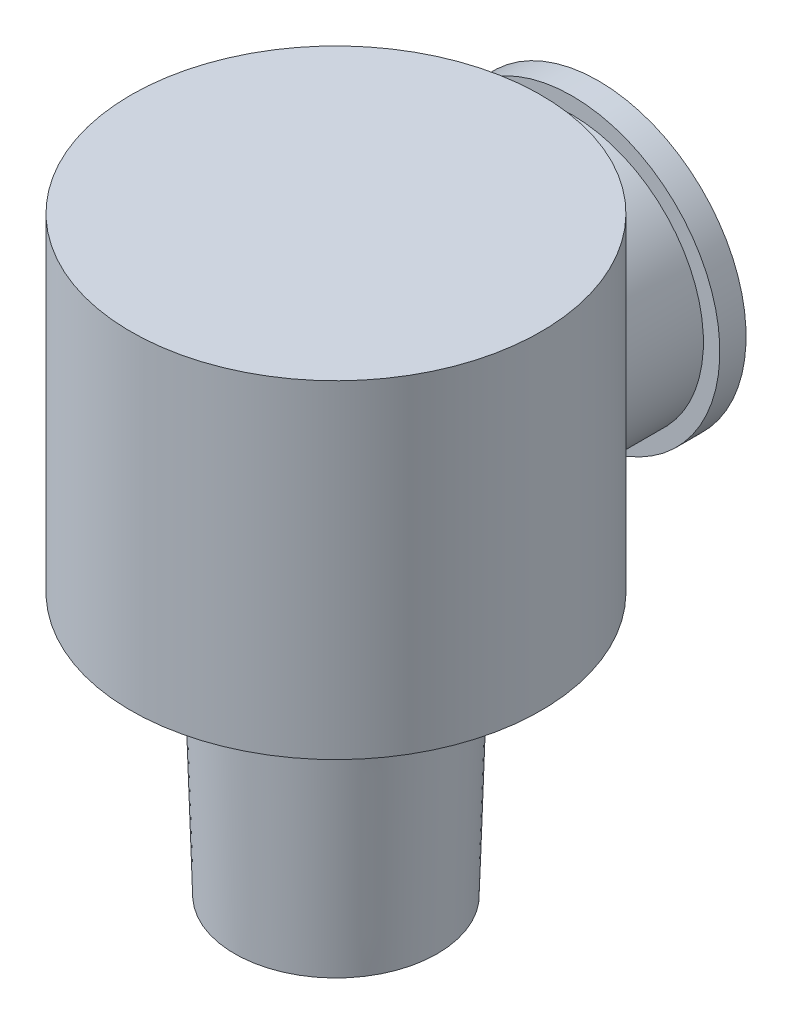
ISO-10303-21;
HEADER;
FILE_DESCRIPTION(('STEP AP214'),'2;1');
FILE_NAME('part.step','',(''),(''),'','','');
FILE_SCHEMA(('AUTOMOTIVE_DESIGN { 1 0 10303 214 1 1 1 1 }'));
ENDSEC;
DATA;
#1=APPLICATION_CONTEXT('core data for automotive mechanical design processes');
#2=APPLICATION_PROTOCOL_DEFINITION('international standard','automotive_design',2000,#1);
#3=PRODUCT_CONTEXT('',#1,'mechanical');
#4=PRODUCT('Part','Part','',(#3));
#5=PRODUCT_RELATED_PRODUCT_CATEGORY('part','',(#4));
#6=PRODUCT_DEFINITION_FORMATION('','',#4);
#7=PRODUCT_DEFINITION_CONTEXT('part definition',#1,'design');
#8=PRODUCT_DEFINITION('design','',#6,#7);
#9=PRODUCT_DEFINITION_SHAPE('','',#8);
#10=(LENGTH_UNIT() NAMED_UNIT(*) SI_UNIT(.MILLI.,.METRE.));
#11=(NAMED_UNIT(*) PLANE_ANGLE_UNIT() SI_UNIT($,.RADIAN.));
#12=(NAMED_UNIT(*) SI_UNIT($,.STERADIAN.) SOLID_ANGLE_UNIT());
#13=UNCERTAINTY_MEASURE_WITH_UNIT(LENGTH_MEASURE(1.E-05),#10,'distance_accuracy_value','');
#14=(GEOMETRIC_REPRESENTATION_CONTEXT(3) GLOBAL_UNCERTAINTY_ASSIGNED_CONTEXT((#13)) GLOBAL_UNIT_ASSIGNED_CONTEXT((#10,
#11,#12)) REPRESENTATION_CONTEXT('',''));
#15=CARTESIAN_POINT('',(0.,0.,0.));
#16=DIRECTION('',(0.,0.,1.));
#17=DIRECTION('',(1.,0.,0.));
#18=AXIS2_PLACEMENT_3D('',#15,#16,#17);
#19=CARTESIAN_POINT('',(0.,-10.31875,0.));
#20=DIRECTION('',(0.,1.,0.));
#21=DIRECTION('',(-1.,0.,0.));
#22=AXIS2_PLACEMENT_3D('',#19,#20,#21);
#23=CYLINDRICAL_SURFACE('',#22,9.921875);
#24=CARTESIAN_POINT('',(0.,2.38125,0.));
#25=DIRECTION('',(0.,1.,0.));
#26=DIRECTION('',(-1.,0.,0.));
#27=AXIS2_PLACEMENT_3D('',#24,#25,#26);
#28=CIRCLE('',#27,9.921875);
#29=CARTESIAN_POINT('',(-9.921875,2.38125,0.));
#30=VERTEX_POINT('',#29);
#31=EDGE_CURVE('E82',#30,#30,#28,.T.);
#32=ORIENTED_EDGE('',*,*,#31,.T.);
#33=EDGE_LOOP('',(#32));
#34=FACE_BOUND('',#33,.T.);
#35=CARTESIAN_POINT('',(0.,18.25625,0.));
#36=DIRECTION('',(0.,1.,0.));
#37=DIRECTION('',(-1.,0.,0.));
#38=AXIS2_PLACEMENT_3D('',#35,#36,#37);
#39=CIRCLE('',#38,9.921875);
#40=CARTESIAN_POINT('',(-9.921875,18.25625,0.));
#41=VERTEX_POINT('',#40);
#42=EDGE_CURVE('E85',#41,#41,#39,.T.);
#43=ORIENTED_EDGE('',*,*,#42,.F.);
#44=EDGE_LOOP('',(#43));
#45=FACE_BOUND('',#44,.T.);
#46=CARTESIAN_POINT('',(0.,3.96875,-9.921875));
#47=CARTESIAN_POINT('',(-0.16070407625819,3.96874943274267,-9.92187549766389));
#48=CARTESIAN_POINT('',(-0.321402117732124,3.97485798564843,-9.91796259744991));
#49=CARTESIAN_POINT('',(-0.641558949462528,3.99920227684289,-9.90240874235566));
#50=CARTESIAN_POINT('',(-0.801017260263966,4.01744249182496,-9.89076493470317));
#51=CARTESIAN_POINT('',(-1.11757950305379,4.06581573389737,-9.86001734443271));
#52=CARTESIAN_POINT('',(-1.27468038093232,4.09596300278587,-9.84090462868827));
#53=CARTESIAN_POINT('',(-1.58526394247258,4.16774540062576,-9.79567176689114));
#54=CARTESIAN_POINT('',(-1.73874506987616,4.20938537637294,-9.76954866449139));
#55=CARTESIAN_POINT('',(-2.04021533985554,4.30336889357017,-9.71105381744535));
#56=CARTESIAN_POINT('',(-2.18822988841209,4.35565276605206,-9.67871696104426));
#57=CARTESIAN_POINT('',(-2.47885929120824,4.47048496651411,-9.60839512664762));
#58=CARTESIAN_POINT('',(-2.62147202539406,4.53303727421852,-9.57040795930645));
#59=CARTESIAN_POINT('',(-3.03999522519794,4.73513486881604,-9.44913597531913));
#60=CARTESIAN_POINT('',(-3.30691329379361,4.88922290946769,-9.35847557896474));
#61=CARTESIAN_POINT('',(-3.83309318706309,5.24537437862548,-9.15625482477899));
#62=CARTESIAN_POINT('',(-4.08994408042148,5.45033054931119,-9.04359164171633));
#63=CARTESIAN_POINT('',(-4.56806919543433,5.89583982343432,-8.81174985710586));
#64=CARTESIAN_POINT('',(-4.78929329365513,6.13644218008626,-8.69256238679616));
#65=CARTESIAN_POINT('',(-5.10645740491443,6.53967288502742,-8.50797266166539));
#66=CARTESIAN_POINT('',(-5.2155033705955,6.69161774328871,-8.44137673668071));
#67=CARTESIAN_POINT('',(-5.42032291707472,7.00547886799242,-8.31134284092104));
#68=CARTESIAN_POINT('',(-5.51609382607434,7.1673971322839,-8.24790550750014));
#69=CARTESIAN_POINT('',(-5.78205586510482,7.66691958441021,-8.06581856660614));
#70=CARTESIAN_POINT('',(-5.9315347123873,8.01909774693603,-7.95500354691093));
#71=CARTESIAN_POINT('',(-6.13459670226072,8.65489231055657,-7.79886266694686));
#72=CARTESIAN_POINT('',(-6.20317385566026,8.93135317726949,-7.74393345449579));
#73=CARTESIAN_POINT('',(-6.27789649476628,9.35385995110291,-7.68326579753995));
#74=CARTESIAN_POINT('',(-6.29811169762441,9.49595479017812,-7.66666597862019));
#75=CARTESIAN_POINT('',(-6.32889855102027,9.78190842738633,-7.64127399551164));
#76=CARTESIAN_POINT('',(-6.33947009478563,9.92576724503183,-7.63248191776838));
#77=CARTESIAN_POINT('',(-6.35079574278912,10.2145877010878,-7.6230602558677));
#78=CARTESIAN_POINT('',(-6.35151908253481,10.3595513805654,-7.62245625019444));
#79=CARTESIAN_POINT('',(-6.34305974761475,10.64898544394,-7.62949714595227));
#80=CARTESIAN_POINT('',(-6.33387702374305,10.7934558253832,-7.63714208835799));
#81=CARTESIAN_POINT('',(-6.30575342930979,11.0808715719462,-7.66037915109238));
#82=CARTESIAN_POINT('',(-6.28680749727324,11.2238161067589,-7.67597539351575));
#83=CARTESIAN_POINT('',(-6.23946140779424,11.5071468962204,-7.7145087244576));
#84=CARTESIAN_POINT('',(-6.21105731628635,11.647532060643,-7.73744886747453));
#85=CARTESIAN_POINT('',(-6.11421904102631,12.0551502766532,-7.81451545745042));
#86=CARTESIAN_POINT('',(-6.03323180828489,12.3178083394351,-7.87770732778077));
#87=CARTESIAN_POINT('',(-5.8403758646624,12.8260694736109,-8.02172205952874));
#88=CARTESIAN_POINT('',(-5.72849689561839,13.0716668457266,-8.10255077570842));
#89=CARTESIAN_POINT('',(-5.45212101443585,13.5896551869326,-8.29162600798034));
#90=CARTESIAN_POINT('',(-5.28163304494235,13.8580460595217,-8.40215208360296));
#91=CARTESIAN_POINT('',(-4.99845093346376,14.2383214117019,-8.57153922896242));
#92=CARTESIAN_POINT('',(-4.89938518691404,14.3614572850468,-8.6286517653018));
#93=CARTESIAN_POINT('',(-4.69233544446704,14.6000378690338,-8.74297191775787));
#94=CARTESIAN_POINT('',(-4.58434983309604,14.7154811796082,-8.80017954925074));
#95=CARTESIAN_POINT('',(-4.33926160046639,14.9586109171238,-8.92393121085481));
#96=CARTESIAN_POINT('',(-4.20044462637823,15.0846783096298,-8.99027050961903));
#97=CARTESIAN_POINT('',(-3.91135827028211,15.3246512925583,-9.11975621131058));
#98=CARTESIAN_POINT('',(-3.76109268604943,15.4385608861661,-9.18290366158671));
#99=CARTESIAN_POINT('',(-3.44976660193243,15.6532926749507,-9.30433308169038));
#100=CARTESIAN_POINT('',(-3.28871271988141,15.7541227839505,-9.36261798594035));
#101=CARTESIAN_POINT('',(-2.95654102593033,15.9417136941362,-9.47275351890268));
#102=CARTESIAN_POINT('',(-2.78542602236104,16.0284783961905,-9.52460593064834));
#103=CARTESIAN_POINT('',(-2.46900977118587,16.1711303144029,-9.61087453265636));
#104=CARTESIAN_POINT('',(-2.32531221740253,16.2297292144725,-9.64670979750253));
#105=CARTESIAN_POINT('',(-2.03283654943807,16.3365820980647,-9.71255034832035));
#106=CARTESIAN_POINT('',(-1.88405943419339,16.3848381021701,-9.7425567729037));
#107=CARTESIAN_POINT('',(-1.58235034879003,16.4704359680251,-9.79608231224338));
#108=CARTESIAN_POINT('',(-1.42942097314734,16.5077844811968,-9.81960538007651));
#109=CARTESIAN_POINT('',(-1.12031615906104,16.5711318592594,-9.85965412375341));
#110=CARTESIAN_POINT('',(-0.964140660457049,16.5971305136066,-9.87617966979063));
#111=CARTESIAN_POINT('',(-0.649144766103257,16.6374846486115,-9.90188202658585));
#112=CARTESIAN_POINT('',(-0.490317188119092,16.6518002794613,-9.91103368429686));
#113=CARTESIAN_POINT('',(-0.17177656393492,16.6684293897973,-9.92166774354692));
#114=CARTESIAN_POINT('',(-0.01206351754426,16.6707428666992,-9.92315014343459));
#115=CARTESIAN_POINT('',(0.306976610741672,16.6633325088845,-9.91840827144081));
#116=CARTESIAN_POINT('',(0.466303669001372,16.6536079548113,-9.91218353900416));
#117=CARTESIAN_POINT('',(0.783296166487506,16.6222661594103,-9.89218250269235));
#118=CARTESIAN_POINT('',(0.940961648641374,16.600649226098,-9.87840639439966));
#119=CARTESIAN_POINT('',(1.24509401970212,16.5472957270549,-9.84456614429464));
#120=CARTESIAN_POINT('',(1.39170896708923,16.5161619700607,-9.82487755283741));
#121=CARTESIAN_POINT('',(1.68151415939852,16.443890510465,-9.77945140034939));
#122=CARTESIAN_POINT('',(1.8247032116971,16.4027493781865,-9.7537117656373));
#123=CARTESIAN_POINT('',(2.24780678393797,16.2649825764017,-9.66817086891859));
#124=CARTESIAN_POINT('',(2.52150144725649,16.1539698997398,-9.60001927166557));
#125=CARTESIAN_POINT('',(3.06636576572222,15.8881885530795,-9.44074202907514));
#126=CARTESIAN_POINT('',(3.33584053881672,15.7307839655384,-9.34828673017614));
#127=CARTESIAN_POINT('',(3.84586190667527,15.3811205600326,-9.15029603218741));
#128=CARTESIAN_POINT('',(4.08638581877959,15.1888347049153,-9.04475050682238));
#129=CARTESIAN_POINT('',(4.57034084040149,14.7413110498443,-8.81125420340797));
#130=CARTESIAN_POINT('',(4.80861137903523,14.4809443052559,-8.68234264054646));
#131=CARTESIAN_POINT('',(5.1318537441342,14.0627645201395,-8.49255023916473));
#132=CARTESIAN_POINT('',(5.23395109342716,13.9186849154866,-8.42985053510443));
#133=CARTESIAN_POINT('',(5.4262848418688,13.6216673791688,-8.30734707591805));
#134=CARTESIAN_POINT('',(5.51652171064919,13.468729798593,-8.24754320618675));
#135=CARTESIAN_POINT('',(5.74558152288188,13.0400268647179,-8.09090485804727));
#136=CARTESIAN_POINT('',(5.87212895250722,12.7556830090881,-7.99869967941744));
#137=CARTESIAN_POINT('',(6.03064219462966,12.3133500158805,-7.87904564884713));
#138=CARTESIAN_POINT('',(6.078258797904,12.1632850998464,-7.84227264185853));
#139=CARTESIAN_POINT('',(6.16251511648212,11.8585101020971,-7.77623778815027));
#140=CARTESIAN_POINT('',(6.1991602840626,11.7038023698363,-7.74697221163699));
#141=CARTESIAN_POINT('',(6.26120646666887,11.3891533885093,-7.69691573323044));
#142=CARTESIAN_POINT('',(6.28649242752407,11.2291754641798,-7.67621170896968));
#143=CARTESIAN_POINT('',(6.32479758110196,10.9067785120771,-7.64468181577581));
#144=CARTESIAN_POINT('',(6.33781709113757,10.7443595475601,-7.63385569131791));
#145=CARTESIAN_POINT('',(6.35130217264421,10.4187375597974,-7.6226401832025));
#146=CARTESIAN_POINT('',(6.35177544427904,10.2555350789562,-7.62224439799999));
#147=CARTESIAN_POINT('',(6.34017620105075,9.92989918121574,-7.63189528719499));
#148=CARTESIAN_POINT('',(6.32810468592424,9.76746570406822,-7.6419411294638));
#149=CARTESIAN_POINT('',(6.29431785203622,9.46825129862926,-7.66978244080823));
#150=CARTESIAN_POINT('',(6.27424802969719,9.33115508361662,-7.68624840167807));
#151=CARTESIAN_POINT('',(6.22541582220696,9.05947963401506,-7.7258513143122));
#152=CARTESIAN_POINT('',(6.19665096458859,8.9249011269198,-7.74899016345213));
#153=CARTESIAN_POINT('',(6.09781749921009,8.52594534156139,-7.82734783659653));
#154=CARTESIAN_POINT('',(6.01521127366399,8.26635874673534,-7.89150667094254));
#155=CARTESIAN_POINT('',(5.7859221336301,7.67732049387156,-8.06184061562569));
#156=CARTESIAN_POINT('',(5.62696719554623,7.35462844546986,-8.17487553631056));
#157=CARTESIAN_POINT('',(5.35228277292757,6.89715042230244,-8.35516516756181));
#158=CARTESIAN_POINT('',(5.2545529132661,6.74893739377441,-8.4171246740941));
#159=CARTESIAN_POINT('',(5.0474474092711,6.46166625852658,-8.54292259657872));
#160=CARTESIAN_POINT('',(4.93807262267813,6.32260747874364,-8.60676087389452));
#161=CARTESIAN_POINT('',(4.70681795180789,6.05256291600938,-8.735398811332));
#162=CARTESIAN_POINT('',(4.58480520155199,5.92169237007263,-8.80020089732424));
#163=CARTESIAN_POINT('',(4.32980558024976,5.6703825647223,-8.92842365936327));
#164=CARTESIAN_POINT('',(4.1968193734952,5.54994267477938,-8.99184441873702));
#165=CARTESIAN_POINT('',(3.92029959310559,5.32014314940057,-9.11580020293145));
#166=CARTESIAN_POINT('',(3.77676486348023,5.21078473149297,-9.17633491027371));
#167=CARTESIAN_POINT('',(3.47967573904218,5.00394837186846,-9.29305825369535));
#168=CARTESIAN_POINT('',(3.32612054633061,4.90647137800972,-9.34924654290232));
#169=CARTESIAN_POINT('',(3.00457350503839,4.72138071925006,-9.45758081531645));
#170=CARTESIAN_POINT('',(2.8362760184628,4.6341856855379,-9.50953839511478));
#171=CARTESIAN_POINT('',(2.49081816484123,4.4745647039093,-9.6058083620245));
#172=CARTESIAN_POINT('',(2.31366276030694,4.40213059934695,-9.65012496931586));
#173=CARTESIAN_POINT('',(1.95215222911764,4.27322817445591,-9.72969021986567));
#174=CARTESIAN_POINT('',(1.76781564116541,4.21672149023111,-9.76496063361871));
#175=CARTESIAN_POINT('',(1.39330426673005,4.12048091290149,-9.82538737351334));
#176=CARTESIAN_POINT('',(1.20313366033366,4.08073529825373,-9.85055076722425));
#177=CARTESIAN_POINT('',(0.844498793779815,4.02289575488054,-9.88728783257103));
#178=CARTESIAN_POINT('',(0.67652259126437,4.00262098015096,-9.90022645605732));
#179=CARTESIAN_POINT('',(0.339028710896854,3.97554824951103,-9.91751987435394));
#180=CARTESIAN_POINT('',(0.169510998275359,3.96875059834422,-9.92187447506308));
#181=CARTESIAN_POINT('',(0.,3.96875,-9.921875));
#182=B_SPLINE_CURVE_WITH_KNOTS('',3,(#46,#47,#48,#49,#50,#51,#52,#53,#54,#55,#56,#57,#58,#59,
#60,#61,#62,#63,#64,#65,#66,#67,#68,#69,#70,#71,#72,#73,#74,#75,#76,#77,#78,#79,#80,#81,#82,#83,
#84,#85,#86,#87,#88,#89,#90,#91,#92,#93,#94,#95,#96,#97,#98,#99,#100,#101,#102,#103,#104,#105,
#106,#107,#108,#109,#110,#111,#112,#113,#114,#115,#116,#117,#118,#119,#120,#121,#122,#123,#124,
#125,#126,#127,#128,#129,#130,#131,#132,#133,#134,#135,#136,#137,#138,#139,#140,#141,#142,#143,
#144,#145,#146,#147,#148,#149,#150,#151,#152,#153,#154,#155,#156,#157,#158,#159,#160,#161,#162,
#163,#164,#165,#166,#167,#168,#169,#170,#171,#172,#173,#174,#175,#176,#177,#178,#179,#180,#181),
.UNSPECIFIED.,.T.,.F.,(4,2,2,2,2,2,2,2,2,2,2,2,2,2,2,2,2,2,2,2,2,2,2,2,2,2,2,2,2,2,2,2,2,2,2,2,
2,2,2,2,2,2,2,2,2,2,2,2,2,2,2,2,2,2,2,2,2,2,2,2,2,2,2,2,2,2,2,4),(0.,0.481939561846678,
0.96405706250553,1.44675296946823,1.92965275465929,2.4099165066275,2.890366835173,
3.8502452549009,4.88861624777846,5.92843560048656,6.52335966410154,7.11840329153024,
8.30523250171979,9.17168203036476,9.6046498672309,10.0376224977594,10.4719473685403,
10.9062743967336,11.3408268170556,11.775560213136,12.6182048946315,13.4611297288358,
14.4670238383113,14.9708349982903,15.4747376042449,16.0707442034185,16.6665539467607,
17.2620014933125,17.8572836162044,18.3346087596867,18.8118405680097,19.2887807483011,
19.7657297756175,20.2442989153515,20.7228681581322,21.2014660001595,21.6800514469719,
22.133050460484,22.5862049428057,23.4917747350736,24.4645517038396,25.4380859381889,
26.5602254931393,27.1218745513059,27.6835013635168,28.652782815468,29.1373277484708,
29.6216314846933,30.1107357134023,30.5998272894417,31.0886186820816,31.5773711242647,
31.995502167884,32.4137522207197,33.2502851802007,34.3751596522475,34.9388271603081,
35.5024531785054,36.0727603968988,36.6430331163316,37.2133684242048,37.7837492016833,
38.3724949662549,38.9609145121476,39.5479043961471,40.1344830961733,40.6428224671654,
41.1511733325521),.UNSPECIFIED.);
#183=CARTESIAN_POINT('',(0.,3.96875,-9.921875));
#184=VERTEX_POINT('',#183);
#185=EDGE_CURVE('E43',#184,#184,#182,.T.);
#186=ORIENTED_EDGE('',*,*,#185,.F.);
#187=EDGE_LOOP('',(#186));
#188=FACE_BOUND('',#187,.T.);
#189=ADVANCED_FACE('F30',(#34,#45,#188),#23,.T.);
#190=CARTESIAN_POINT('',(0.,-10.31875,0.));
#191=DIRECTION('',(0.,1.,0.));
#192=DIRECTION('',(-1.,0.,0.));
#193=AXIS2_PLACEMENT_3D('',#190,#191,#192);
#194=CYLINDRICAL_SURFACE('',#193,5.207);
#195=CARTESIAN_POINT('',(0.,2.38125,0.));
#196=DIRECTION('',(0.,1.,0.));
#197=DIRECTION('',(-1.,0.,0.));
#198=AXIS2_PLACEMENT_3D('',#195,#196,#197);
#199=CIRCLE('',#198,5.207);
#200=CARTESIAN_POINT('',(-5.207,2.38125,0.));
#201=VERTEX_POINT('',#200);
#202=EDGE_CURVE('E79',#201,#201,#199,.T.);
#203=ORIENTED_EDGE('',*,*,#202,.F.);
#204=EDGE_LOOP('',(#203));
#205=FACE_BOUND('',#204,.T.);
#206=CARTESIAN_POINT('',(0.,0.,0.));
#207=DIRECTION('',(0.,1.,0.));
#208=DIRECTION('',(-1.,0.,0.));
#209=AXIS2_PLACEMENT_3D('',#206,#207,#208);
#210=CIRCLE('',#209,5.207);
#211=CARTESIAN_POINT('',(-5.207,0.,0.));
#212=VERTEX_POINT('',#211);
#213=EDGE_CURVE('E91',#212,#212,#210,.T.);
#214=ORIENTED_EDGE('',*,*,#213,.T.);
#215=EDGE_LOOP('',(#214));
#216=FACE_BOUND('',#215,.T.);
#217=ADVANCED_FACE('F32',(#205,#216),#194,.T.);
#218=CARTESIAN_POINT('',(0.,-10.31875,0.));
#219=DIRECTION('',(0.,1.,0.));
#220=DIRECTION('',(-1.,0.,0.));
#221=AXIS2_PLACEMENT_3D('',#218,#219,#220);
#222=CONICAL_SURFACE('',#221,4.90299982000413,0.0294524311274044);
#223=ORIENTED_EDGE('',*,*,#213,.F.);
#224=EDGE_LOOP('',(#223));
#225=FACE_BOUND('',#224,.T.);
#226=CARTESIAN_POINT('',(0.,-10.31875,0.));
#227=DIRECTION('',(0.,1.,0.));
#228=DIRECTION('',(-1.,0.,0.));
#229=AXIS2_PLACEMENT_3D('',#226,#227,#228);
#230=CIRCLE('',#229,4.90299982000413);
#231=CARTESIAN_POINT('',(-4.90299982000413,-10.31875,0.));
#232=VERTEX_POINT('',#231);
#233=EDGE_CURVE('E88',#232,#232,#230,.T.);
#234=ORIENTED_EDGE('',*,*,#233,.T.);
#235=EDGE_LOOP('',(#234));
#236=FACE_BOUND('',#235,.T.);
#237=ADVANCED_FACE('F135',(#225,#236),#222,.T.);
#238=CARTESIAN_POINT('',(4.90299982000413,-10.31875,0.));
#239=DIRECTION('',(0.,1.,0.));
#240=DIRECTION('',(-1.,0.,0.));
#241=AXIS2_PLACEMENT_3D('',#238,#239,#240);
#242=PLANE('',#241);
#243=CARTESIAN_POINT('',(0.,-10.31875,0.));
#244=DIRECTION('',(0.,-1.,0.));
#245=DIRECTION('',(0.,0.,-1.));
#246=AXIS2_PLACEMENT_3D('',#243,#244,#245);
#247=CIRCLE('',#246,3.96875);
#248=CARTESIAN_POINT('',(0.,-10.31875,-3.96875));
#249=VERTEX_POINT('',#248);
#250=EDGE_CURVE('E62',#249,#249,#247,.T.);
#251=ORIENTED_EDGE('',*,*,#250,.F.);
#252=EDGE_LOOP('',(#251));
#253=FACE_BOUND('',#252,.T.);
#254=ORIENTED_EDGE('',*,*,#233,.F.);
#255=EDGE_LOOP('',(#254));
#256=FACE_BOUND('',#255,.T.);
#257=ADVANCED_FACE('F126',(#253,#256),#242,.F.);
#258=CARTESIAN_POINT('',(0.,18.25625,0.));
#259=DIRECTION('',(0.,-1.,0.));
#260=DIRECTION('',(1.,0.,0.));
#261=AXIS2_PLACEMENT_3D('',#258,#259,#260);
#262=PLANE('',#261);
#263=ORIENTED_EDGE('',*,*,#42,.T.);
#264=EDGE_LOOP('',(#263));
#265=FACE_BOUND('',#264,.T.);
#266=ADVANCED_FACE('F121',(#265),#262,.F.);
#267=CARTESIAN_POINT('',(9.921875,2.38125,0.));
#268=DIRECTION('',(0.,1.,0.));
#269=DIRECTION('',(-1.,0.,0.));
#270=AXIS2_PLACEMENT_3D('',#267,#268,#269);
#271=PLANE('',#270);
#272=ORIENTED_EDGE('',*,*,#31,.F.);
#273=EDGE_LOOP('',(#272));
#274=FACE_BOUND('',#273,.T.);
#275=ORIENTED_EDGE('',*,*,#202,.T.);
#276=EDGE_LOOP('',(#275));
#277=FACE_BOUND('',#276,.T.);
#278=ADVANCED_FACE('F107',(#274,#277),#271,.F.);
#279=CARTESIAN_POINT('',(0.,10.31875,-12.7));
#280=DIRECTION('',(0.,0.,1.));
#281=DIRECTION('',(0.,-1.,0.));
#282=AXIS2_PLACEMENT_3D('',#279,#280,#281);
#283=CYLINDRICAL_SURFACE('',#282,6.35);
#284=CARTESIAN_POINT('',(0.,10.31875,-11.43));
#285=DIRECTION('',(0.,0.,1.));
#286=DIRECTION('',(0.,-1.,0.));
#287=AXIS2_PLACEMENT_3D('',#284,#285,#286);
#288=CIRCLE('',#287,6.35);
#289=CARTESIAN_POINT('',(0.,3.96875,-11.43));
#290=VERTEX_POINT('',#289);
#291=EDGE_CURVE('E66',#290,#290,#288,.T.);
#292=ORIENTED_EDGE('',*,*,#291,.T.);
#293=EDGE_LOOP('',(#292));
#294=FACE_BOUND('',#293,.T.);
#295=ORIENTED_EDGE('',*,*,#185,.T.);
#296=EDGE_LOOP('',(#295));
#297=FACE_BOUND('',#296,.T.);
#298=ADVANCED_FACE('F101',(#294,#297),#283,.T.);
#299=CARTESIAN_POINT('',(0.,10.31875,-12.7));
#300=DIRECTION('',(0.,0.,1.));
#301=DIRECTION('',(0.,-1.,0.));
#302=AXIS2_PLACEMENT_3D('',#299,#300,#301);
#303=PLANE('',#302);
#304=CARTESIAN_POINT('',(0.,10.31875,-12.7));
#305=DIRECTION('',(0.,0.,-1.));
#306=DIRECTION('',(0.,1.,0.));
#307=AXIS2_PLACEMENT_3D('',#304,#305,#306);
#308=CIRCLE('',#307,4.76249999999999);
#309=CARTESIAN_POINT('',(0.,15.08125,-12.7));
#310=VERTEX_POINT('',#309);
#311=EDGE_CURVE('E61',#310,#310,#308,.T.);
#312=ORIENTED_EDGE('',*,*,#311,.F.);
#313=EDGE_LOOP('',(#312));
#314=FACE_BOUND('',#313,.T.);
#315=CARTESIAN_POINT('',(0.,10.31875,-12.7));
#316=DIRECTION('',(0.,0.,1.));
#317=DIRECTION('',(0.,-1.,0.));
#318=AXIS2_PLACEMENT_3D('',#315,#316,#317);
#319=CIRCLE('',#318,7.14375);
#320=CARTESIAN_POINT('',(0.,3.175,-12.7));
#321=VERTEX_POINT('',#320);
#322=EDGE_CURVE('E76',#321,#321,#319,.T.);
#323=ORIENTED_EDGE('',*,*,#322,.F.);
#324=EDGE_LOOP('',(#323));
#325=FACE_BOUND('',#324,.T.);
#326=ADVANCED_FACE('F106',(#314,#325),#303,.F.);
#327=CARTESIAN_POINT('',(0.,10.31875,-12.7));
#328=DIRECTION('',(0.,0.,1.));
#329=DIRECTION('',(0.,-1.,0.));
#330=AXIS2_PLACEMENT_3D('',#327,#328,#329);
#331=CYLINDRICAL_SURFACE('',#330,7.14375);
#332=CARTESIAN_POINT('',(0.,10.31875,-11.43));
#333=DIRECTION('',(0.,0.,1.));
#334=DIRECTION('',(0.,-1.,0.));
#335=AXIS2_PLACEMENT_3D('',#332,#333,#334);
#336=CIRCLE('',#335,7.14375);
#337=CARTESIAN_POINT('',(0.,3.175,-11.43));
#338=VERTEX_POINT('',#337);
#339=EDGE_CURVE('E69',#338,#338,#336,.T.);
#340=ORIENTED_EDGE('',*,*,#339,.F.);
#341=EDGE_LOOP('',(#340));
#342=FACE_BOUND('',#341,.T.);
#343=ORIENTED_EDGE('',*,*,#322,.T.);
#344=EDGE_LOOP('',(#343));
#345=FACE_BOUND('',#344,.T.);
#346=ADVANCED_FACE('F113',(#342,#345),#331,.T.);
#347=CARTESIAN_POINT('',(0.,17.4625,-11.43));
#348=DIRECTION('',(0.,0.,-1.));
#349=DIRECTION('',(0.,1.,0.));
#350=AXIS2_PLACEMENT_3D('',#347,#348,#349);
#351=PLANE('',#350);
#352=ORIENTED_EDGE('',*,*,#291,.F.);
#353=EDGE_LOOP('',(#352));
#354=FACE_BOUND('',#353,.T.);
#355=ORIENTED_EDGE('',*,*,#339,.T.);
#356=EDGE_LOOP('',(#355));
#357=FACE_BOUND('',#356,.T.);
#358=ADVANCED_FACE('F110',(#354,#357),#351,.F.);
#359=CARTESIAN_POINT('',(0.,10.31875,3.175));
#360=DIRECTION('',(0.,0.,-1.));
#361=DIRECTION('',(0.,1.,0.));
#362=AXIS2_PLACEMENT_3D('',#359,#360,#361);
#363=CONICAL_SURFACE('',#362,4.76249999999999,1.02974425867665);
#364=CARTESIAN_POINT('',(0.,10.31875,6.03659869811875));
#365=VERTEX_POINT('',#364);
#366=VERTEX_LOOP('',#365);
#367=FACE_BOUND('',#366,.T.);
#368=CARTESIAN_POINT('',(0.,10.31875,3.175));
#369=DIRECTION('',(0.,0.,-1.));
#370=DIRECTION('',(0.,1.,0.));
#371=AXIS2_PLACEMENT_3D('',#368,#369,#370);
#372=CIRCLE('',#371,4.76249999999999);
#373=CARTESIAN_POINT('',(-2.38125,6.19430401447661,3.175));
#374=VERTEX_POINT('',#373);
#375=CARTESIAN_POINT('',(2.38125,6.19430401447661,3.175));
#376=VERTEX_POINT('',#375);
#377=EDGE_CURVE('E60',#374,#376,#372,.T.);
#378=ORIENTED_EDGE('',*,*,#377,.T.);
#379=CARTESIAN_POINT('',(2.48381171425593,6.1008040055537,3.095425));
#380=CARTESIAN_POINT('',(2.43185348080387,6.15076562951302,3.13711795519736));
#381=CARTESIAN_POINT('',(2.37766379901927,6.19878512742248,3.17844838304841));
#382=CARTESIAN_POINT('',(2.26471427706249,6.29041662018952,3.25989240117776));
#383=CARTESIAN_POINT('',(2.20594976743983,6.33402400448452,3.30000468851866));
#384=CARTESIAN_POINT('',(2.08416747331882,6.4159890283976,3.37822864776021));
#385=CARTESIAN_POINT('',(2.02117334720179,6.45437274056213,3.41634962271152));
#386=CARTESIAN_POINT('',(1.89087957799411,6.52573340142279,3.49015080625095));
#387=CARTESIAN_POINT('',(1.82358182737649,6.55871270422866,3.5258320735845));
#388=CARTESIAN_POINT('',(1.68463837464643,6.61928956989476,3.59430117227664));
#389=CARTESIAN_POINT('',(1.61296981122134,6.64685495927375,3.62707110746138));
#390=CARTESIAN_POINT('',(1.46618325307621,6.69649723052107,3.68885143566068));
#391=CARTESIAN_POINT('',(1.39106462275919,6.71857309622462,3.71786113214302));
#392=CARTESIAN_POINT('',(1.23805512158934,6.75762740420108,3.77157380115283));
#393=CARTESIAN_POINT('',(1.16016517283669,6.77460752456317,3.79627819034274));
#394=CARTESIAN_POINT('',(1.00219368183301,6.80406990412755,3.84100604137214));
#395=CARTESIAN_POINT('',(0.922111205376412,6.81655021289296,3.86102747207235));
#396=CARTESIAN_POINT('',(0.761901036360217,6.83743850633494,3.8957767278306));
#397=CARTESIAN_POINT('',(0.681802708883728,6.84591888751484,3.91059730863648));
#398=CARTESIAN_POINT('',(0.520576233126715,6.85968867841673,3.93530551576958));
#399=CARTESIAN_POINT('',(0.439447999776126,6.86497782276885,3.94519273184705));
#400=CARTESIAN_POINT('',(0.276453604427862,6.87276651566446,3.95995692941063));
#401=CARTESIAN_POINT('',(0.194586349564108,6.87526085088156,3.96482454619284));
#402=CARTESIAN_POINT('',(0.030689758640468,6.87764610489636,3.9694780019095));
#403=CARTESIAN_POINT('',(-0.0513395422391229,6.87753753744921,3.96926484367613));
#404=CARTESIAN_POINT('',(-0.230081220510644,6.87445678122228,3.96325867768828));
#405=CARTESIAN_POINT('',(-0.326753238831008,6.87096784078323,3.95645881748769));
#406=CARTESIAN_POINT('',(-0.519131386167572,6.85995610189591,3.9358403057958));
#407=CARTESIAN_POINT('',(-0.614837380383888,6.85243274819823,3.92202068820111));
#408=CARTESIAN_POINT('',(-0.804329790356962,6.83261698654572,3.88758050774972));
#409=CARTESIAN_POINT('',(-0.898119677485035,6.82033419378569,3.8669736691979));
#410=CARTESIAN_POINT('',(-1.08309499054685,6.79003687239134,3.81929295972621));
#411=CARTESIAN_POINT('',(-1.17428090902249,6.77202343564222,3.79222032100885));
#412=CARTESIAN_POINT('',(-1.34958369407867,6.73014537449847,3.73333795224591));
#413=CARTESIAN_POINT('',(-1.43383755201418,6.70653736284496,3.70175510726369));
#414=CARTESIAN_POINT('',(-1.5981621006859,6.6525349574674,3.63383514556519));
#415=CARTESIAN_POINT('',(-1.67823280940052,6.62214059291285,3.59749804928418));
#416=CARTESIAN_POINT('',(-1.83342476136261,6.5543618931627,3.52094049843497));
#417=CARTESIAN_POINT('',(-1.90854494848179,6.51697607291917,3.48071921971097));
#418=CARTESIAN_POINT('',(-2.05327512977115,6.43549296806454,3.39735376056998));
#419=CARTESIAN_POINT('',(-2.12288687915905,6.39139783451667,3.35421051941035));
#420=CARTESIAN_POINT('',(-2.24224165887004,6.30713078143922,3.27525738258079));
#421=CARTESIAN_POINT('',(-2.29306633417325,6.26811184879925,3.2398339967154));
#422=CARTESIAN_POINT('',(-2.39108854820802,6.18681874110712,3.168176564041));
#423=CARTESIAN_POINT('',(-2.43829692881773,6.1445551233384,3.13194539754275));
#424=CARTESIAN_POINT('',(-2.48381171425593,6.1008040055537,3.095425));
#425=B_SPLINE_CURVE_WITH_KNOTS('',3,(#379,#380,#381,#382,#383,#384,#385,#386,#387,#388,#389,
#390,#391,#392,#393,#394,#395,#396,#397,#398,#399,#400,#401,#402,#403,#404,#405,#406,#407,#408,
#409,#410,#411,#412,#413,#414,#415,#416,#417,#418,#419,#420,#421,#422,#423,#424),.UNSPECIFIED.,
.F.,.F.,(4,2,2,2,2,2,2,2,2,2,2,2,2,2,2,2,2,2,2,2,2,2,4),(0.,0.249830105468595,0.49991863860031,
0.748709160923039,0.997391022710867,1.24750876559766,1.49767277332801,1.74775430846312,
1.99794411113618,2.24341313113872,2.48890256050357,2.73484915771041,2.9807472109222,
3.2713263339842,3.56194545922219,3.85198050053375,4.14196031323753,4.42059024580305,
4.6992189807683,4.97790696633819,5.25650578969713,5.47598706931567,5.69478224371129),.UNSPECIFIED.);
#426=EDGE_CURVE('E49',#376,#374,#425,.T.);
#427=ORIENTED_EDGE('',*,*,#426,.T.);
#428=EDGE_LOOP('',(#378,#427));
#429=FACE_BOUND('',#428,.T.);
#430=ADVANCED_FACE('F59',(#367,#429),#363,.F.);
#431=CARTESIAN_POINT('',(0.,10.31875,-12.7));
#432=DIRECTION('',(0.,0.,-1.));
#433=DIRECTION('',(0.,1.,0.));
#434=AXIS2_PLACEMENT_3D('',#431,#432,#433);
#435=CYLINDRICAL_SURFACE('',#434,4.76249999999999);
#436=ORIENTED_EDGE('',*,*,#377,.F.);
#437=CARTESIAN_POINT('',(-2.38125,6.19430401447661,3.175));
#438=CARTESIAN_POINT('',(-2.48150738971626,6.25217538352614,3.09977256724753));
#439=CARTESIAN_POINT('',(-2.57731166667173,6.312372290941,3.02053201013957));
#440=CARTESIAN_POINT('',(-2.7599629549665,6.4359500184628,2.85461954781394));
#441=CARTESIAN_POINT('',(-2.84681290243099,6.49932978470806,2.76795009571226));
#442=CARTESIAN_POINT('',(-3.01229577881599,6.62841180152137,2.58693110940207));
#443=CARTESIAN_POINT('',(-3.09084962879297,6.69412958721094,2.49252067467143));
#444=CARTESIAN_POINT('',(-3.23884758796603,6.82574734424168,2.29693016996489));
#445=CARTESIAN_POINT('',(-3.30829240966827,6.89164730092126,2.19575063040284));
#446=CARTESIAN_POINT('',(-3.42282407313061,7.00655367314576,2.01100626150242));
#447=CARTESIAN_POINT('',(-3.46981444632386,7.05591555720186,1.92883673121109));
#448=CARTESIAN_POINT('',(-3.55823209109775,7.15257309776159,1.76040006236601));
#449=CARTESIAN_POINT('',(-3.59966054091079,7.19986919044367,1.67413379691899));
#450=CARTESIAN_POINT('',(-3.67661685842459,7.29097218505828,1.49756819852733));
#451=CARTESIAN_POINT('',(-3.71216139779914,7.33478875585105,1.4072812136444));
#452=CARTESIAN_POINT('',(-3.77709358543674,7.4174173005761,1.22235108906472));
#453=CARTESIAN_POINT('',(-3.80648447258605,7.4562319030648,1.12771027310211));
#454=CARTESIAN_POINT('',(-3.86624336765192,7.53724136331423,0.905516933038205));
#455=CARTESIAN_POINT('',(-3.89436787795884,7.57708655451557,0.776455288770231));
#456=CARTESIAN_POINT('',(-3.93780189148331,7.639828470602,0.512351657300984));
#457=CARTESIAN_POINT('',(-3.95314485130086,7.66276942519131,0.377326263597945));
#458=CARTESIAN_POINT('',(-3.96979393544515,7.68770242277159,0.103243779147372));
#459=CARTESIAN_POINT('',(-3.97098502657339,7.68952278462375,-0.0358371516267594));
#460=CARTESIAN_POINT('',(-3.95888989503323,7.67135816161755,-0.311999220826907));
#461=CARTESIAN_POINT('',(-3.94558386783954,7.65134334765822,-0.449077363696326));
#462=CARTESIAN_POINT('',(-3.90136326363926,7.5869821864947,-0.746850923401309));
#463=CARTESIAN_POINT('',(-3.86720562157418,7.53823419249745,-0.906066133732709));
#464=CARTESIAN_POINT('',(-3.78205633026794,7.42349129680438,-1.21353260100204));
#465=CARTESIAN_POINT('',(-3.73101024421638,7.35744076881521,-1.36174648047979));
#466=CARTESIAN_POINT('',(-3.6263902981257,7.23070926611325,-1.61711750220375));
#467=CARTESIAN_POINT('',(-3.57560533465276,7.17181998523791,-1.72635418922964));
#468=CARTESIAN_POINT('',(-3.46523666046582,7.05068437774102,-1.93840368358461));
#469=CARTESIAN_POINT('',(-3.40564826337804,6.98843627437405,-2.04121302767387));
#470=CARTESIAN_POINT('',(-3.27786682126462,6.86258811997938,-2.24067118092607));
#471=CARTESIAN_POINT('',(-3.20966313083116,6.79898647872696,-2.33731214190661));
#472=CARTESIAN_POINT('',(-3.06480567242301,6.67215696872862,-2.52426656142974));
#473=CARTESIAN_POINT('',(-2.98815355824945,6.6089290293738,-2.61458125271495));
#474=CARTESIAN_POINT('',(-2.82394273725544,6.48236853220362,-2.79129107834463));
#475=CARTESIAN_POINT('',(-2.73612402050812,6.41909080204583,-2.87748466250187));
#476=CARTESIAN_POINT('',(-2.55150675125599,6.29587262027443,-3.04238586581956));
#477=CARTESIAN_POINT('',(-2.454706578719,6.23593277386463,-3.12109212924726));
#478=CARTESIAN_POINT('',(-2.25249248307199,6.120993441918,-3.27000976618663));
#479=CARTESIAN_POINT('',(-2.14710248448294,6.06598107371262,-3.34024346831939));
#480=CARTESIAN_POINT('',(-1.9278886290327,5.96221742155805,-3.47139023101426));
#481=CARTESIAN_POINT('',(-1.81406948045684,5.91346268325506,-3.53230843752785));
#482=CARTESIAN_POINT('',(-1.53636547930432,5.80763865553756,-3.66356476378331));
#483=CARTESIAN_POINT('',(-1.36908153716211,5.75378778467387,-3.72953659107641));
#484=CARTESIAN_POINT('',(-1.10953338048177,5.68643089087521,-3.81158574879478));
#485=CARTESIAN_POINT('',(-1.02156255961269,5.66621256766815,-3.83612045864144));
#486=CARTESIAN_POINT('',(-0.84322572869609,5.63061349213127,-3.87921951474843));
#487=CARTESIAN_POINT('',(-0.752860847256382,5.61523050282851,-3.89778662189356));
#488=CARTESIAN_POINT('',(-0.569814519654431,5.58955222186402,-3.92873472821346));
#489=CARTESIAN_POINT('',(-0.477122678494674,5.57928695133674,-3.94107922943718));
#490=CARTESIAN_POINT('',(-0.29069398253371,5.56421059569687,-3.95919695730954));
#491=CARTESIAN_POINT('',(-0.196957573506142,5.55939726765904,-3.96497288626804));
#492=CARTESIAN_POINT('',(-0.009175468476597,5.55533348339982,-3.96985007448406));
#493=CARTESIAN_POINT('',(0.0848702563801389,5.5560835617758,-3.96895069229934));
#494=CARTESIAN_POINT('',(0.27242595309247,5.56312014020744,-3.96050361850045));
#495=CARTESIAN_POINT('',(0.365935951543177,5.56940636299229,-3.95295625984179));
#496=CARTESIAN_POINT('',(0.629475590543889,5.59493225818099,-3.92226479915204));
#497=CARTESIAN_POINT('',(0.798072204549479,5.62060911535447,-3.89135478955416));
#498=CARTESIAN_POINT('',(1.12663631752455,5.68837963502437,-3.80925579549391));
#499=CARTESIAN_POINT('',(1.28660250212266,5.73047579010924,-3.75806373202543));
#500=CARTESIAN_POINT('',(1.60485284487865,5.83149588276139,-3.63406051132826));
#501=CARTESIAN_POINT('',(1.76239687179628,5.89131249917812,-3.56009104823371));
#502=CARTESIAN_POINT('',(2.06273453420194,6.02300030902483,-3.39492699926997));
#503=CARTESIAN_POINT('',(2.20551772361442,6.09487994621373,-3.30372034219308));
#504=CARTESIAN_POINT('',(2.44003456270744,6.22720640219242,-3.13247872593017));
#505=CARTESIAN_POINT('',(2.53534651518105,6.28571951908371,-3.05577058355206));
#506=CARTESIAN_POINT('',(2.71737686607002,6.40605697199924,-2.89509517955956));
#507=CARTESIAN_POINT('',(2.80409502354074,6.46788140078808,-2.81112771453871));
#508=CARTESIAN_POINT('',(2.9690961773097,6.59361117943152,-2.63627255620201));
#509=CARTESIAN_POINT('',(3.04735913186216,6.65752102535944,-2.54536925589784));
#510=CARTESIAN_POINT('',(3.1952027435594,6.78581145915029,-2.35711251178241));
#511=CARTESIAN_POINT('',(3.26478577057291,6.85019191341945,-2.25976083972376));
#512=CARTESIAN_POINT('',(3.38339866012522,6.96619822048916,-2.07683018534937));
#513=CARTESIAN_POINT('',(3.43386923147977,7.01802393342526,-1.99230869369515));
#514=CARTESIAN_POINT('',(3.52882996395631,7.11974954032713,-1.8188231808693));
#515=CARTESIAN_POINT('',(3.57331926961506,7.16964915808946,-1.72985852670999));
#516=CARTESIAN_POINT('',(3.65596659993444,7.26599218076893,-1.54753863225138));
#517=CARTESIAN_POINT('',(3.69414021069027,7.31244393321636,-1.4541949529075));
#518=CARTESIAN_POINT('',(3.76386773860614,7.40021493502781,-1.2627930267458));
#519=CARTESIAN_POINT('',(3.7954257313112,7.44153733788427,-1.16473772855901));
#520=CARTESIAN_POINT('',(3.85827718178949,7.52616637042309,-0.938924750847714));
#521=CARTESIAN_POINT('',(3.88758120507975,7.56744349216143,-0.809811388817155));
#522=CARTESIAN_POINT('',(3.93338353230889,7.63331710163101,-0.545333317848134));
#523=CARTESIAN_POINT('',(3.94991271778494,7.65795379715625,-0.40998452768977));
#524=CARTESIAN_POINT('',(3.96887287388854,7.68629950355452,-0.134755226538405));
#525=CARTESIAN_POINT('',(3.97117737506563,7.68982077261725,0.00515484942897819));
#526=CARTESIAN_POINT('',(3.96108139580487,7.67464445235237,0.283249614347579));
#527=CARTESIAN_POINT('',(3.94866757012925,7.65592669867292,0.421432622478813));
#528=CARTESIAN_POINT('',(3.9066017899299,7.59451534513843,0.718475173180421));
#529=CARTESIAN_POINT('',(3.87403891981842,7.5478292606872,0.876054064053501));
#530=CARTESIAN_POINT('',(3.79235924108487,7.4370639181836,1.1807022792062));
#531=CARTESIAN_POINT('',(3.74317885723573,7.37291804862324,1.32772857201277));
#532=CARTESIAN_POINT('',(3.64195523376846,7.2491234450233,1.58168846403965));
#533=CARTESIAN_POINT('',(3.59260594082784,7.19128669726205,1.69062667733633));
#534=CARTESIAN_POINT('',(3.48522507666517,7.07205193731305,1.90217367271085));
#535=CARTESIAN_POINT('',(3.42718809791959,7.01065172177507,2.00477845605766));
#536=CARTESIAN_POINT('',(3.30278626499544,6.88644249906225,2.20370717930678));
#537=CARTESIAN_POINT('',(3.23642955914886,6.82363491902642,2.30003712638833));
#538=CARTESIAN_POINT('',(3.09547624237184,6.69820671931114,2.48649347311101));
#539=CARTESIAN_POINT('',(3.02088388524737,6.63558602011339,2.57662303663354));
#540=CARTESIAN_POINT('',(2.85799693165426,6.50762067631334,2.75654991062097));
#541=CARTESIAN_POINT('',(2.76911177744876,6.4423866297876,2.84589429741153));
#542=CARTESIAN_POINT('',(2.58211414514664,6.31539217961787,3.01655294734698));
#543=CARTESIAN_POINT('',(2.48402106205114,6.25362489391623,3.09788338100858));
#544=CARTESIAN_POINT('',(2.38125,6.19430401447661,3.175));
#545=B_SPLINE_CURVE_WITH_KNOTS('',3,(#437,#438,#439,#440,#441,#442,#443,#444,#445,#446,#447,
#448,#449,#450,#451,#452,#453,#454,#455,#456,#457,#458,#459,#460,#461,#462,#463,#464,#465,#466,
#467,#468,#469,#470,#471,#472,#473,#474,#475,#476,#477,#478,#479,#480,#481,#482,#483,#484,#485,
#486,#487,#488,#489,#490,#491,#492,#493,#494,#495,#496,#497,#498,#499,#500,#501,#502,#503,#504,
#505,#506,#507,#508,#509,#510,#511,#512,#513,#514,#515,#516,#517,#518,#519,#520,#521,#522,#523,
#524,#525,#526,#527,#528,#529,#530,#531,#532,#533,#534,#535,#536,#537,#538,#539,#540,#541,#542,
#543,#544),.UNSPECIFIED.,.F.,.F.,(4,2,2,2,2,2,2,2,2,2,2,2,2,2,2,2,2,2,2,2,2,2,2,2,2,2,2,2,2,2,2,
2,2,2,2,2,2,2,2,2,2,2,2,2,2,2,2,2,2,2,2,2,2,4),(0.,0.413919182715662,0.827702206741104,
1.24512836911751,1.66252186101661,1.98256960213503,2.30254943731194,2.62160650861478,
2.94049522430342,3.3529480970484,3.76431792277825,4.17902929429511,4.59430791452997,
5.10141464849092,5.61017213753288,6.01194350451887,6.41392952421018,6.81641720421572,
7.21882623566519,7.63342271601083,8.0480941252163,8.46164765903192,8.87497191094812,
9.43543048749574,9.71576750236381,9.99597463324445,10.27780669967,10.5595227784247,
10.841265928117,11.1229949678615,11.6404246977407,12.1579330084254,12.7080267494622,
13.2585071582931,13.6648667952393,14.0712378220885,14.4785518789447,14.8857544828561,
15.2192706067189,15.5528343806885,15.885562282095,16.2180846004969,16.6327141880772,
17.0463382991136,17.463634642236,17.8813096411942,18.3811574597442,18.8829396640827,
19.2809825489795,19.6792742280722,20.0771788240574,20.4748788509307,20.9000479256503,
21.3243407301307),.UNSPECIFIED.);
#546=EDGE_CURVE('E11',#374,#376,#545,.T.);
#547=ORIENTED_EDGE('',*,*,#546,.T.);
#548=EDGE_LOOP('',(#436,#547));
#549=FACE_BOUND('',#548,.T.);
#550=ORIENTED_EDGE('',*,*,#311,.T.);
#551=EDGE_LOOP('',(#550));
#552=FACE_BOUND('',#551,.T.);
#553=ADVANCED_FACE('F64',(#549,#552),#435,.F.);
#554=CARTESIAN_POINT('',(0.,-10.31875,0.));
#555=DIRECTION('',(0.,-1.,0.));
#556=DIRECTION('',(0.,0.,-1.));
#557=AXIS2_PLACEMENT_3D('',#554,#555,#556);
#558=CYLINDRICAL_SURFACE('',#557,3.96875);
#559=ORIENTED_EDGE('',*,*,#250,.T.);
#560=EDGE_LOOP('',(#559));
#561=FACE_BOUND('',#560,.T.);
#562=ORIENTED_EDGE('',*,*,#546,.F.);
#563=ORIENTED_EDGE('',*,*,#426,.F.);
#564=EDGE_LOOP('',(#562,#563));
#565=FACE_BOUND('',#564,.T.);
#566=ADVANCED_FACE('F54',(#561,#565),#558,.F.);
#567=CLOSED_SHELL('',(#189,#217,#237,#257,#266,#278,#298,#326,#346,#358,#430,#553,#566));
#568=MANIFOLD_SOLID_BREP('B2',#567);
#569=ADVANCED_BREP_SHAPE_REPRESENTATION('',(#18,#568),#14);
#570=SHAPE_DEFINITION_REPRESENTATION(#9,#569);
ENDSEC;
END-ISO-10303-21;
